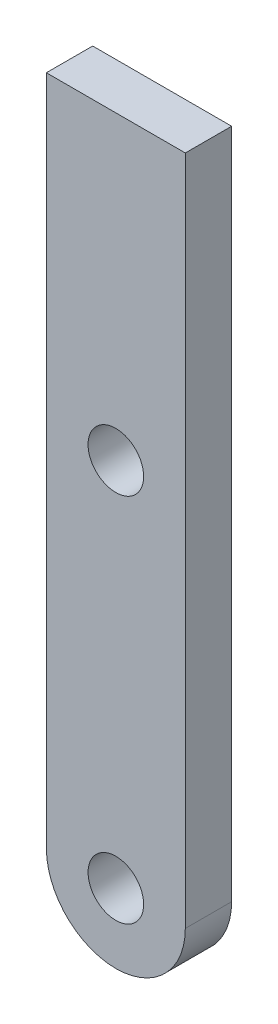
ISO-10303-21;
HEADER;
FILE_DESCRIPTION(('STEP AP214'),'2;1');
FILE_NAME('part.step','',(''),(''),'','','');
FILE_SCHEMA(('AUTOMOTIVE_DESIGN { 1 0 10303 214 1 1 1 1 }'));
ENDSEC;
DATA;
#1=APPLICATION_CONTEXT('core data for automotive mechanical design processes');
#2=APPLICATION_PROTOCOL_DEFINITION('international standard','automotive_design',2000,#1);
#3=PRODUCT_CONTEXT('',#1,'mechanical');
#4=PRODUCT('Part','Part','',(#3));
#5=PRODUCT_RELATED_PRODUCT_CATEGORY('part','',(#4));
#6=PRODUCT_DEFINITION_FORMATION('','',#4);
#7=PRODUCT_DEFINITION_CONTEXT('part definition',#1,'design');
#8=PRODUCT_DEFINITION('design','',#6,#7);
#9=PRODUCT_DEFINITION_SHAPE('','',#8);
#10=(LENGTH_UNIT() NAMED_UNIT(*) SI_UNIT(.MILLI.,.METRE.));
#11=(NAMED_UNIT(*) PLANE_ANGLE_UNIT() SI_UNIT($,.RADIAN.));
#12=(NAMED_UNIT(*) SI_UNIT($,.STERADIAN.) SOLID_ANGLE_UNIT());
#13=UNCERTAINTY_MEASURE_WITH_UNIT(LENGTH_MEASURE(1.E-05),#10,'distance_accuracy_value','');
#14=(GEOMETRIC_REPRESENTATION_CONTEXT(3) GLOBAL_UNCERTAINTY_ASSIGNED_CONTEXT((#13)) GLOBAL_UNIT_ASSIGNED_CONTEXT((#10,
#11,#12)) REPRESENTATION_CONTEXT('',''));
#15=CARTESIAN_POINT('',(0.,0.,0.));
#16=DIRECTION('',(0.,0.,1.));
#17=DIRECTION('',(1.,0.,0.));
#18=AXIS2_PLACEMENT_3D('',#15,#16,#17);
#19=CARTESIAN_POINT('',(0.,0.,10.));
#20=DIRECTION('',(1.,0.,0.));
#21=DIRECTION('',(0.,1.,0.));
#22=AXIS2_PLACEMENT_3D('',#19,#20,#21);
#23=PLANE('',#22);
#24=DIRECTION('',(0.,-1.,0.));
#25=VECTOR('',#24,1.);
#26=CARTESIAN_POINT('',(0.,0.,0.));
#27=LINE('',#26,#25);
#28=CARTESIAN_POINT('',(0.,0.,0.));
#29=VERTEX_POINT('',#28);
#30=CARTESIAN_POINT('',(0.,-145.,0.));
#31=VERTEX_POINT('',#30);
#32=EDGE_CURVE('E93',#29,#31,#27,.T.);
#33=ORIENTED_EDGE('',*,*,#32,.T.);
#34=DIRECTION('',(0.,0.,-1.));
#35=VECTOR('',#34,1.);
#36=CARTESIAN_POINT('',(0.,-145.,10.));
#37=LINE('',#36,#35);
#38=CARTESIAN_POINT('',(0.,-145.,10.));
#39=VERTEX_POINT('',#38);
#40=EDGE_CURVE('E11',#39,#31,#37,.T.);
#41=ORIENTED_EDGE('',*,*,#40,.F.);
#42=DIRECTION('',(0.,-1.,0.));
#43=VECTOR('',#42,1.);
#44=CARTESIAN_POINT('',(0.,0.,10.));
#45=LINE('',#44,#43);
#46=CARTESIAN_POINT('',(0.,0.,10.));
#47=VERTEX_POINT('',#46);
#48=EDGE_CURVE('E81',#47,#39,#45,.T.);
#49=ORIENTED_EDGE('',*,*,#48,.F.);
#50=DIRECTION('',(0.,0.,-1.));
#51=VECTOR('',#50,1.);
#52=CARTESIAN_POINT('',(0.,0.,10.));
#53=LINE('',#52,#51);
#54=EDGE_CURVE('E89',#47,#29,#53,.T.);
#55=ORIENTED_EDGE('',*,*,#54,.T.);
#56=EDGE_LOOP('',(#33,#41,#49,#55));
#57=FACE_BOUND('',#56,.T.);
#58=ADVANCED_FACE('F30',(#57),#23,.F.);
#59=CARTESIAN_POINT('',(15.,-145.,10.));
#60=DIRECTION('',(0.,0.,-1.));
#61=DIRECTION('',(-1.,0.,0.));
#62=AXIS2_PLACEMENT_3D('',#59,#60,#61);
#63=CYLINDRICAL_SURFACE('',#62,15.);
#64=CARTESIAN_POINT('',(15.,-145.,0.));
#65=DIRECTION('',(0.,0.,1.));
#66=DIRECTION('',(1.,0.,0.));
#67=AXIS2_PLACEMENT_3D('',#64,#65,#66);
#68=CIRCLE('',#67,15.);
#69=CARTESIAN_POINT('',(30.,-145.,0.));
#70=VERTEX_POINT('',#69);
#71=EDGE_CURVE('E85',#31,#70,#68,.T.);
#72=ORIENTED_EDGE('',*,*,#71,.T.);
#73=DIRECTION('',(0.,0.,-1.));
#74=VECTOR('',#73,1.);
#75=CARTESIAN_POINT('',(30.,-145.,10.));
#76=LINE('',#75,#74);
#77=CARTESIAN_POINT('',(30.,-145.,10.));
#78=VERTEX_POINT('',#77);
#79=EDGE_CURVE('E38',#78,#70,#76,.T.);
#80=ORIENTED_EDGE('',*,*,#79,.F.);
#81=CARTESIAN_POINT('',(15.,-145.,10.));
#82=DIRECTION('',(0.,0.,1.));
#83=DIRECTION('',(1.,0.,0.));
#84=AXIS2_PLACEMENT_3D('',#81,#82,#83);
#85=CIRCLE('',#84,15.);
#86=EDGE_CURVE('E76',#39,#78,#85,.T.);
#87=ORIENTED_EDGE('',*,*,#86,.F.);
#88=ORIENTED_EDGE('',*,*,#40,.T.);
#89=EDGE_LOOP('',(#72,#80,#87,#88));
#90=FACE_BOUND('',#89,.T.);
#91=ADVANCED_FACE('F84',(#90),#63,.T.);
#92=CARTESIAN_POINT('',(30.,0.,10.));
#93=DIRECTION('',(-1.,0.,0.));
#94=DIRECTION('',(0.,-1.,0.));
#95=AXIS2_PLACEMENT_3D('',#92,#93,#94);
#96=PLANE('',#95);
#97=DIRECTION('',(0.,1.,0.));
#98=VECTOR('',#97,1.);
#99=CARTESIAN_POINT('',(30.,0.,0.));
#100=LINE('',#99,#98);
#101=CARTESIAN_POINT('',(30.,0.,0.));
#102=VERTEX_POINT('',#101);
#103=EDGE_CURVE('E63',#70,#102,#100,.T.);
#104=ORIENTED_EDGE('',*,*,#103,.T.);
#105=DIRECTION('',(0.,0.,-1.));
#106=VECTOR('',#105,1.);
#107=CARTESIAN_POINT('',(30.,0.,10.));
#108=LINE('',#107,#106);
#109=CARTESIAN_POINT('',(30.,0.,10.));
#110=VERTEX_POINT('',#109);
#111=EDGE_CURVE('E86',#110,#102,#108,.T.);
#112=ORIENTED_EDGE('',*,*,#111,.F.);
#113=DIRECTION('',(0.,1.,0.));
#114=VECTOR('',#113,1.);
#115=CARTESIAN_POINT('',(30.,0.,10.));
#116=LINE('',#115,#114);
#117=EDGE_CURVE('E79',#78,#110,#116,.T.);
#118=ORIENTED_EDGE('',*,*,#117,.F.);
#119=ORIENTED_EDGE('',*,*,#79,.T.);
#120=EDGE_LOOP('',(#104,#112,#118,#119));
#121=FACE_BOUND('',#120,.T.);
#122=ADVANCED_FACE('F87',(#121),#96,.F.);
#123=CARTESIAN_POINT('',(0.,0.,10.));
#124=DIRECTION('',(0.,-1.,0.));
#125=DIRECTION('',(0.,0.,-1.));
#126=AXIS2_PLACEMENT_3D('',#123,#124,#125);
#127=PLANE('',#126);
#128=DIRECTION('',(-1.,0.,0.));
#129=VECTOR('',#128,1.);
#130=CARTESIAN_POINT('',(0.,0.,0.));
#131=LINE('',#130,#129);
#132=EDGE_CURVE('E69',#102,#29,#131,.T.);
#133=ORIENTED_EDGE('',*,*,#132,.T.);
#134=ORIENTED_EDGE('',*,*,#54,.F.);
#135=DIRECTION('',(-1.,0.,0.));
#136=VECTOR('',#135,1.);
#137=CARTESIAN_POINT('',(0.,0.,10.));
#138=LINE('',#137,#136);
#139=EDGE_CURVE('E46',#110,#47,#138,.T.);
#140=ORIENTED_EDGE('',*,*,#139,.F.);
#141=ORIENTED_EDGE('',*,*,#111,.T.);
#142=EDGE_LOOP('',(#133,#134,#140,#141));
#143=FACE_BOUND('',#142,.T.);
#144=ADVANCED_FACE('F101',(#143),#127,.F.);
#145=CARTESIAN_POINT('',(15.,-145.,10.));
#146=DIRECTION('',(0.,0.,1.));
#147=DIRECTION('',(1.,0.,0.));
#148=AXIS2_PLACEMENT_3D('',#145,#146,#147);
#149=PLANE('',#148);
#150=CARTESIAN_POINT('',(15.,-65.,10.));
#151=DIRECTION('',(0.,0.,1.));
#152=DIRECTION('',(1.,0.,0.));
#153=AXIS2_PLACEMENT_3D('',#150,#151,#152);
#154=CIRCLE('',#153,6.);
#155=CARTESIAN_POINT('',(21.,-65.,10.));
#156=VERTEX_POINT('',#155);
#157=EDGE_CURVE('E113',#156,#156,#154,.T.);
#158=ORIENTED_EDGE('',*,*,#157,.F.);
#159=EDGE_LOOP('',(#158));
#160=FACE_BOUND('',#159,.T.);
#161=CARTESIAN_POINT('',(15.,-145.,10.));
#162=DIRECTION('',(0.,0.,1.));
#163=DIRECTION('',(1.,0.,0.));
#164=AXIS2_PLACEMENT_3D('',#161,#162,#163);
#165=CIRCLE('',#164,6.);
#166=CARTESIAN_POINT('',(21.,-145.,10.));
#167=VERTEX_POINT('',#166);
#168=EDGE_CURVE('E107',#167,#167,#165,.T.);
#169=ORIENTED_EDGE('',*,*,#168,.F.);
#170=EDGE_LOOP('',(#169));
#171=FACE_BOUND('',#170,.T.);
#172=ORIENTED_EDGE('',*,*,#48,.T.);
#173=ORIENTED_EDGE('',*,*,#86,.T.);
#174=ORIENTED_EDGE('',*,*,#117,.T.);
#175=ORIENTED_EDGE('',*,*,#139,.T.);
#176=EDGE_LOOP('',(#172,#173,#174,#175));
#177=FACE_BOUND('',#176,.T.);
#178=ADVANCED_FACE('F77',(#160,#171,#177),#149,.T.);
#179=CARTESIAN_POINT('',(15.,-145.,0.));
#180=DIRECTION('',(0.,0.,1.));
#181=DIRECTION('',(1.,0.,0.));
#182=AXIS2_PLACEMENT_3D('',#179,#180,#181);
#183=PLANE('',#182);
#184=CARTESIAN_POINT('',(15.,-65.,0.));
#185=DIRECTION('',(0.,0.,1.));
#186=DIRECTION('',(1.,0.,0.));
#187=AXIS2_PLACEMENT_3D('',#184,#185,#186);
#188=CIRCLE('',#187,6.);
#189=CARTESIAN_POINT('',(21.,-65.,0.));
#190=VERTEX_POINT('',#189);
#191=EDGE_CURVE('E110',#190,#190,#188,.T.);
#192=ORIENTED_EDGE('',*,*,#191,.T.);
#193=EDGE_LOOP('',(#192));
#194=FACE_BOUND('',#193,.T.);
#195=CARTESIAN_POINT('',(15.,-145.,0.));
#196=DIRECTION('',(0.,0.,1.));
#197=DIRECTION('',(1.,0.,0.));
#198=AXIS2_PLACEMENT_3D('',#195,#196,#197);
#199=CIRCLE('',#198,6.);
#200=CARTESIAN_POINT('',(21.,-145.,0.));
#201=VERTEX_POINT('',#200);
#202=EDGE_CURVE('E96',#201,#201,#199,.T.);
#203=ORIENTED_EDGE('',*,*,#202,.T.);
#204=EDGE_LOOP('',(#203));
#205=FACE_BOUND('',#204,.T.);
#206=ORIENTED_EDGE('',*,*,#32,.F.);
#207=ORIENTED_EDGE('',*,*,#132,.F.);
#208=ORIENTED_EDGE('',*,*,#103,.F.);
#209=ORIENTED_EDGE('',*,*,#71,.F.);
#210=EDGE_LOOP('',(#206,#207,#208,#209));
#211=FACE_BOUND('',#210,.T.);
#212=ADVANCED_FACE('F104',(#194,#205,#211),#183,.F.);
#213=CARTESIAN_POINT('',(15.,-145.,0.));
#214=DIRECTION('',(0.,0.,1.));
#215=DIRECTION('',(1.,0.,0.));
#216=AXIS2_PLACEMENT_3D('',#213,#214,#215);
#217=CYLINDRICAL_SURFACE('',#216,6.);
#218=ORIENTED_EDGE('',*,*,#202,.F.);
#219=EDGE_LOOP('',(#218));
#220=FACE_BOUND('',#219,.T.);
#221=ORIENTED_EDGE('',*,*,#168,.T.);
#222=EDGE_LOOP('',(#221));
#223=FACE_BOUND('',#222,.T.);
#224=ADVANCED_FACE('F124',(#220,#223),#217,.F.);
#225=CARTESIAN_POINT('',(15.,-65.,0.));
#226=DIRECTION('',(0.,0.,1.));
#227=DIRECTION('',(1.,0.,0.));
#228=AXIS2_PLACEMENT_3D('',#225,#226,#227);
#229=CYLINDRICAL_SURFACE('',#228,6.);
#230=ORIENTED_EDGE('',*,*,#191,.F.);
#231=EDGE_LOOP('',(#230));
#232=FACE_BOUND('',#231,.T.);
#233=ORIENTED_EDGE('',*,*,#157,.T.);
#234=EDGE_LOOP('',(#233));
#235=FACE_BOUND('',#234,.T.);
#236=ADVANCED_FACE('F121',(#232,#235),#229,.F.);
#237=CLOSED_SHELL('',(#58,#91,#122,#144,#178,#212,#224,#236));
#238=MANIFOLD_SOLID_BREP('B2',#237);
#239=ADVANCED_BREP_SHAPE_REPRESENTATION('',(#18,#238),#14);
#240=SHAPE_DEFINITION_REPRESENTATION(#9,#239);
ENDSEC;
END-ISO-10303-21;
